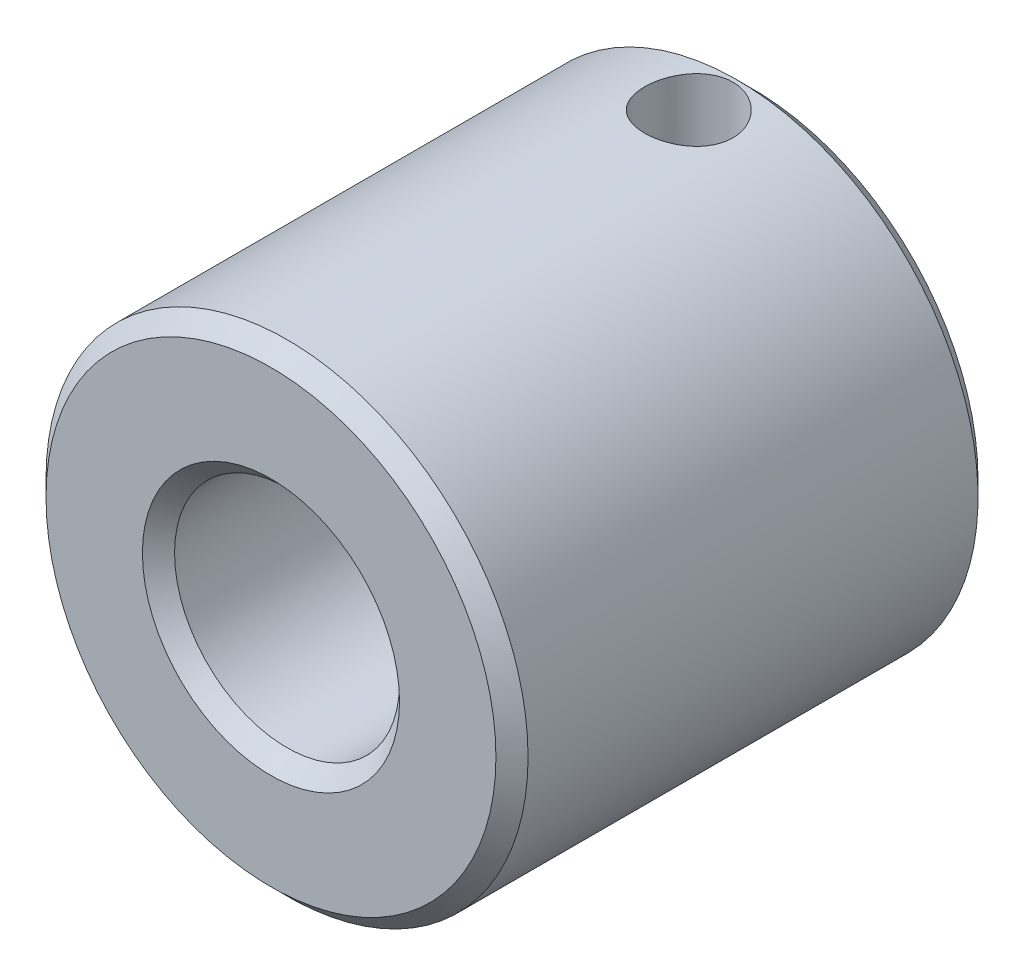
ISO-10303-21;
HEADER;
FILE_DESCRIPTION(('STEP AP214'),'2;1');
FILE_NAME('part.step','',(''),(''),'','','');
FILE_SCHEMA(('AUTOMOTIVE_DESIGN { 1 0 10303 214 1 1 1 1 }'));
ENDSEC;
DATA;
#1=APPLICATION_CONTEXT('core data for automotive mechanical design processes');
#2=APPLICATION_PROTOCOL_DEFINITION('international standard','automotive_design',2000,#1);
#3=PRODUCT_CONTEXT('',#1,'mechanical');
#4=PRODUCT('Part','Part','',(#3));
#5=PRODUCT_RELATED_PRODUCT_CATEGORY('part','',(#4));
#6=PRODUCT_DEFINITION_FORMATION('','',#4);
#7=PRODUCT_DEFINITION_CONTEXT('part definition',#1,'design');
#8=PRODUCT_DEFINITION('design','',#6,#7);
#9=PRODUCT_DEFINITION_SHAPE('','',#8);
#10=(LENGTH_UNIT() NAMED_UNIT(*) SI_UNIT(.MILLI.,.METRE.));
#11=(NAMED_UNIT(*) PLANE_ANGLE_UNIT() SI_UNIT($,.RADIAN.));
#12=(NAMED_UNIT(*) SI_UNIT($,.STERADIAN.) SOLID_ANGLE_UNIT());
#13=UNCERTAINTY_MEASURE_WITH_UNIT(LENGTH_MEASURE(1.E-05),#10,'distance_accuracy_value','');
#14=(GEOMETRIC_REPRESENTATION_CONTEXT(3) GLOBAL_UNCERTAINTY_ASSIGNED_CONTEXT((#13)) GLOBAL_UNIT_ASSIGNED_CONTEXT((#10,
#11,#12)) REPRESENTATION_CONTEXT('',''));
#15=CARTESIAN_POINT('',(0.,0.,0.));
#16=DIRECTION('',(0.,0.,1.));
#17=DIRECTION('',(1.,0.,0.));
#18=AXIS2_PLACEMENT_3D('',#15,#16,#17);
#19=CARTESIAN_POINT('',(0.,15.,4.));
#20=DIRECTION('',(0.,-1.,0.));
#21=DIRECTION('',(0.,0.,-1.));
#22=AXIS2_PLACEMENT_3D('',#19,#20,#21);
#23=CYLINDRICAL_SURFACE('',#22,2.75);
#24=CARTESIAN_POINT('',(0.,7.,6.75));
#25=CARTESIAN_POINT('',(-0.148185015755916,6.99999324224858,6.74999138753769));
#26=CARTESIAN_POINT('',(-0.29650217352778,6.9952447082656,6.73796447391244));
#27=CARTESIAN_POINT('',(-0.588838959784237,6.97673336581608,6.69031068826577));
#28=CARTESIAN_POINT('',(-0.732851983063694,6.96295737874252,6.6546493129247));
#29=CARTESIAN_POINT('',(-1.01207065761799,6.92787575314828,6.56121544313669));
#30=CARTESIAN_POINT('',(-1.14729928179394,6.90659077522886,6.50350358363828));
#31=CARTESIAN_POINT('',(-1.4060866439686,6.8585906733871,6.36786381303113));
#32=CARTESIAN_POINT('',(-1.52964566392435,6.83187568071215,6.28993639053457));
#33=CARTESIAN_POINT('',(-1.76733825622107,6.77437003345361,6.11232819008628));
#34=CARTESIAN_POINT('',(-1.88086697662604,6.74345616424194,6.01187816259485));
#35=CARTESIAN_POINT('',(-2.08996777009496,6.68161260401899,5.79370607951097));
#36=CARTESIAN_POINT('',(-2.18553278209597,6.65068291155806,5.67597726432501));
#37=CARTESIAN_POINT('',(-2.36000969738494,6.59084494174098,5.42048591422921));
#38=CARTESIAN_POINT('',(-2.43803824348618,6.5620790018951,5.28208338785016));
#39=CARTESIAN_POINT('',(-2.56943967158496,6.51175612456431,4.99281550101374));
#40=CARTESIAN_POINT('',(-2.6228234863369,6.49019599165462,4.84195570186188));
#41=CARTESIAN_POINT('',(-2.70098690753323,6.45804886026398,4.53901976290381));
#42=CARTESIAN_POINT('',(-2.72692489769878,6.4470195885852,4.38729111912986));
#43=CARTESIAN_POINT('',(-2.75308014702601,6.43589718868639,4.08126488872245));
#44=CARTESIAN_POINT('',(-2.75330944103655,6.43579894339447,3.92696853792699));
#45=CARTESIAN_POINT('',(-2.72892084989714,6.44617125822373,3.63115742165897));
#46=CARTESIAN_POINT('',(-2.70595946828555,6.45593722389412,3.48947664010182));
#47=CARTESIAN_POINT('',(-2.63859636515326,6.48375840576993,3.21216942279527));
#48=CARTESIAN_POINT('',(-2.59419101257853,6.50181502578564,3.07654401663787));
#49=CARTESIAN_POINT('',(-2.48436529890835,6.54457398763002,2.81199340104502));
#50=CARTESIAN_POINT('',(-2.41854194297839,6.56940216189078,2.68325673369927));
#51=CARTESIAN_POINT('',(-2.26803371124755,6.6228686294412,2.43820046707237));
#52=CARTESIAN_POINT('',(-2.18334269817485,6.65150816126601,2.32188492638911));
#53=CARTESIAN_POINT('',(-1.99011273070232,6.71196143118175,2.09588362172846));
#54=CARTESIAN_POINT('',(-1.880270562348,6.74385301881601,1.98733012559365));
#55=CARTESIAN_POINT('',(-1.643554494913,6.80541474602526,1.78979680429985));
#56=CARTESIAN_POINT('',(-1.51667251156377,6.83508382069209,1.70082632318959));
#57=CARTESIAN_POINT('',(-1.24632382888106,6.8895603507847,1.54356015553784));
#58=CARTESIAN_POINT('',(-1.10258687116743,6.91426423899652,1.47569135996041));
#59=CARTESIAN_POINT('',(-0.804656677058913,6.95521385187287,1.36558569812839));
#60=CARTESIAN_POINT('',(-0.65048517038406,6.97147657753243,1.3232972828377));
#61=CARTESIAN_POINT('',(-0.412349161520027,6.98832346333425,1.27983028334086));
#62=CARTESIAN_POINT('',(-0.330353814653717,6.9926864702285,1.26866141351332));
#63=CARTESIAN_POINT('',(-0.165586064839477,6.99852661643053,1.25374389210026));
#64=CARTESIAN_POINT('',(-0.0828136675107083,7.00000377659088,1.24999518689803));
#65=CARTESIAN_POINT('',(0.148185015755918,6.99999324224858,1.25000861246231));
#66=CARTESIAN_POINT('',(0.296502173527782,6.9952447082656,1.26203552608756));
#67=CARTESIAN_POINT('',(0.588838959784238,6.97673336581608,1.30968931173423));
#68=CARTESIAN_POINT('',(0.732851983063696,6.96295737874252,1.3453506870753));
#69=CARTESIAN_POINT('',(1.01207065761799,6.92787575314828,1.43878455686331));
#70=CARTESIAN_POINT('',(1.14729928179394,6.90659077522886,1.49649641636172));
#71=CARTESIAN_POINT('',(1.4060866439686,6.8585906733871,1.63213618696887));
#72=CARTESIAN_POINT('',(1.52964566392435,6.83187568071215,1.71006360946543));
#73=CARTESIAN_POINT('',(1.76733825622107,6.77437003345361,1.88767180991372));
#74=CARTESIAN_POINT('',(1.88086697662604,6.74345616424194,1.98812183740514));
#75=CARTESIAN_POINT('',(2.08996777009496,6.68161260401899,2.20629392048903));
#76=CARTESIAN_POINT('',(2.18553278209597,6.65068291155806,2.32402273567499));
#77=CARTESIAN_POINT('',(2.36000969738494,6.59084494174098,2.57951408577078));
#78=CARTESIAN_POINT('',(2.43803824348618,6.56207900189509,2.71791661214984));
#79=CARTESIAN_POINT('',(2.56943967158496,6.51175612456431,3.00718449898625));
#80=CARTESIAN_POINT('',(2.6228234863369,6.49019599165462,3.15804429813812));
#81=CARTESIAN_POINT('',(2.70098690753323,6.45804886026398,3.46098023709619));
#82=CARTESIAN_POINT('',(2.72692489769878,6.4470195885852,3.61270888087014));
#83=CARTESIAN_POINT('',(2.75308014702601,6.43589718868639,3.91873511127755));
#84=CARTESIAN_POINT('',(2.75330944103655,6.43579894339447,4.07303146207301));
#85=CARTESIAN_POINT('',(2.72892084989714,6.44617125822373,4.36884257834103));
#86=CARTESIAN_POINT('',(2.70595946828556,6.45593722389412,4.51052335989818));
#87=CARTESIAN_POINT('',(2.63859636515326,6.48375840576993,4.78783057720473));
#88=CARTESIAN_POINT('',(2.59419101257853,6.50181502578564,4.92345598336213));
#89=CARTESIAN_POINT('',(2.48436529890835,6.54457398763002,5.18800659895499));
#90=CARTESIAN_POINT('',(2.41854194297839,6.56940216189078,5.31674326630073));
#91=CARTESIAN_POINT('',(2.26803371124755,6.6228686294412,5.56179953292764));
#92=CARTESIAN_POINT('',(2.18334269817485,6.65150816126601,5.67811507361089));
#93=CARTESIAN_POINT('',(1.99011273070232,6.71196143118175,5.90411637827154));
#94=CARTESIAN_POINT('',(1.880270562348,6.74385301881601,6.01266987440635));
#95=CARTESIAN_POINT('',(1.643554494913,6.80541474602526,6.21020319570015));
#96=CARTESIAN_POINT('',(1.51667251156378,6.83508382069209,6.29917367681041));
#97=CARTESIAN_POINT('',(1.24632382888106,6.8895603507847,6.45643984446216));
#98=CARTESIAN_POINT('',(1.10258687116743,6.91426423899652,6.52430864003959));
#99=CARTESIAN_POINT('',(0.804656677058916,6.95521385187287,6.63441430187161));
#100=CARTESIAN_POINT('',(0.650485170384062,6.97147657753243,6.6767027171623));
#101=CARTESIAN_POINT('',(0.412349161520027,6.98832346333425,6.72016971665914));
#102=CARTESIAN_POINT('',(0.330353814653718,6.9926864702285,6.73133858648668));
#103=CARTESIAN_POINT('',(0.165586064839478,6.99852661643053,6.74625610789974));
#104=CARTESIAN_POINT('',(0.0828136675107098,7.00000377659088,6.75000481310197));
#105=CARTESIAN_POINT('',(0.,7.,6.75));
#106=B_SPLINE_CURVE_WITH_KNOTS('',3,(#24,#25,#26,#27,#28,#29,#30,#31,#32,#33,#34,#35,#36,#37,
#38,#39,#40,#41,#42,#43,#44,#45,#46,#47,#48,#49,#50,#51,#52,#53,#54,#55,#56,#57,#58,#59,#60,#61,
#62,#63,#64,#65,#66,#67,#68,#69,#70,#71,#72,#73,#74,#75,#76,#77,#78,#79,#80,#81,#82,#83,#84,#85,
#86,#87,#88,#89,#90,#91,#92,#93,#94,#95,#96,#97,#98,#99,#100,#101,#102,#103,#104,#105),
.UNSPECIFIED.,.T.,.F.,(4,2,2,2,2,2,2,2,2,2,2,2,2,2,2,2,2,2,2,2,2,2,2,2,2,2,2,2,2,2,2,2,2,2,2,2,
2,2,2,2,4),(0.,0.444233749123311,0.8891174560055,1.33278651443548,1.77644485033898,
2.23853520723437,2.70080682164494,3.18278066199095,3.66454048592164,4.12503938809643,
4.58532271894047,5.01490113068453,5.44455230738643,5.88280670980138,6.32120387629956,
6.79212913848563,7.2632786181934,7.74341814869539,8.2225868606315,8.47085009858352,
8.71911154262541,9.16334529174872,9.6082289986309,10.0518980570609,10.4955563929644,
10.9576467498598,11.4199183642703,11.9018922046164,12.383652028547,12.8441509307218,
13.3044342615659,13.7340126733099,14.1636638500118,14.6019182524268,15.040315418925,
15.511240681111,15.9823901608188,16.4625296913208,16.9416984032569,17.1899616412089,
17.4382230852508),.UNSPECIFIED.);
#107=CARTESIAN_POINT('',(0.,7.,6.75));
#108=VERTEX_POINT('',#107);
#109=EDGE_CURVE('E45',#108,#108,#106,.T.);
#110=ORIENTED_EDGE('',*,*,#109,.T.);
#111=EDGE_LOOP('',(#110));
#112=FACE_BOUND('',#111,.T.);
#113=CARTESIAN_POINT('',(0.,15.,6.75));
#114=CARTESIAN_POINT('',(-0.152939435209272,14.9999967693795,6.74999281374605));
#115=CARTESIAN_POINT('',(-0.306071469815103,14.997634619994,6.7371870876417));
#116=CARTESIAN_POINT('',(-0.608143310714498,14.9884323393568,6.68629994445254));
#117=CARTESIAN_POINT('',(-0.757074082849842,14.9815832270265,6.64816783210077));
#118=CARTESIAN_POINT('',(-1.04615408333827,14.9641738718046,6.54782757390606));
#119=CARTESIAN_POINT('',(-1.18631467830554,14.9536185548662,6.48565137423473));
#120=CARTESIAN_POINT('',(-1.45415890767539,14.9299538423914,6.33906615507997));
#121=CARTESIAN_POINT('',(-1.58184691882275,14.9168453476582,6.25466497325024));
#122=CARTESIAN_POINT('',(-1.82266162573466,14.889350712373,6.06497899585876));
#123=CARTESIAN_POINT('',(-1.9356233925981,14.8749527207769,5.95948649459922));
#124=CARTESIAN_POINT('',(-2.14235500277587,14.8465898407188,5.73105441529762));
#125=CARTESIAN_POINT('',(-2.23612249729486,14.8326250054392,5.60811270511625));
#126=CARTESIAN_POINT('',(-2.40246884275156,14.8065968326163,5.34713206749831));
#127=CARTESIAN_POINT('',(-2.4748830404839,14.7945485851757,5.2089865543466));
#128=CARTESIAN_POINT('',(-2.59541249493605,14.7738822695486,4.92223450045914));
#129=CARTESIAN_POINT('',(-2.64352995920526,14.7652638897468,4.77362891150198));
#130=CARTESIAN_POINT('',(-2.71357913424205,14.7525507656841,4.47191721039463));
#131=CARTESIAN_POINT('',(-2.73579492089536,14.7484069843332,4.31887915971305));
#132=CARTESIAN_POINT('',(-2.75429165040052,14.7449642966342,4.01119574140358));
#133=CARTESIAN_POINT('',(-2.75057477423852,14.7456649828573,3.85655051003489));
#134=CARTESIAN_POINT('',(-2.71754232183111,14.751787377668,3.55209589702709));
#135=CARTESIAN_POINT('',(-2.68854917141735,14.7571496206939,3.40225016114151));
#136=CARTESIAN_POINT('',(-2.60629417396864,14.7718976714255,3.10958521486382));
#137=CARTESIAN_POINT('',(-2.55303114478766,14.7812836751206,2.96676634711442));
#138=CARTESIAN_POINT('',(-2.42342864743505,14.8030846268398,2.69125826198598));
#139=CARTESIAN_POINT('',(-2.34695749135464,14.815516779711,2.55863241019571));
#140=CARTESIAN_POINT('',(-2.17320882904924,14.8419965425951,2.30798340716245));
#141=CARTESIAN_POINT('',(-2.07593087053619,14.8560441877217,2.18996057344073));
#142=CARTESIAN_POINT('',(-1.86160679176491,14.8844299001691,1.97001308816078));
#143=CARTESIAN_POINT('',(-1.74428821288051,14.8987691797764,1.86835393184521));
#144=CARTESIAN_POINT('',(-1.4940603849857,14.9259369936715,1.68607542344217));
#145=CARTESIAN_POINT('',(-1.36114426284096,14.9387648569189,1.60546539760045));
#146=CARTESIAN_POINT('',(-1.08318739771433,14.9614900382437,1.46754334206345));
#147=CARTESIAN_POINT('',(-0.938123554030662,14.9713816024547,1.41027697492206));
#148=CARTESIAN_POINT('',(-0.640402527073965,14.9870605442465,1.32111261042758));
#149=CARTESIAN_POINT('',(-0.487762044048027,14.9928565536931,1.28916124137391));
#150=CARTESIAN_POINT('',(-0.278324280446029,14.9975209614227,1.26354988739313));
#151=CARTESIAN_POINT('',(-0.222792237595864,14.9984485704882,1.2584728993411));
#152=CARTESIAN_POINT('',(-0.111515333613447,14.999688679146,1.25169664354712));
#153=CARTESIAN_POINT('',(-0.0557704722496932,15.0000011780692,1.24999737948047));
#154=CARTESIAN_POINT('',(0.152939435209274,14.9999967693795,1.25000718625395));
#155=CARTESIAN_POINT('',(0.306071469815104,14.997634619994,1.2628129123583));
#156=CARTESIAN_POINT('',(0.6081433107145,14.9884323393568,1.31370005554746));
#157=CARTESIAN_POINT('',(0.757074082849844,14.9815832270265,1.35183216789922));
#158=CARTESIAN_POINT('',(1.04615408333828,14.9641738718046,1.45217242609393));
#159=CARTESIAN_POINT('',(1.18631467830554,14.9536185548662,1.51434862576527));
#160=CARTESIAN_POINT('',(1.45415890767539,14.9299538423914,1.66093384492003));
#161=CARTESIAN_POINT('',(1.58184691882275,14.9168453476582,1.74533502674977));
#162=CARTESIAN_POINT('',(1.82266162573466,14.889350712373,1.93502100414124));
#163=CARTESIAN_POINT('',(1.9356233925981,14.8749527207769,2.04051350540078));
#164=CARTESIAN_POINT('',(2.14235500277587,14.8465898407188,2.26894558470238));
#165=CARTESIAN_POINT('',(2.23612249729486,14.8326250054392,2.39188729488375));
#166=CARTESIAN_POINT('',(2.40246884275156,14.8065968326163,2.65286793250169));
#167=CARTESIAN_POINT('',(2.4748830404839,14.7945485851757,2.7910134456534));
#168=CARTESIAN_POINT('',(2.59541249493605,14.7738822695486,3.07776549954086));
#169=CARTESIAN_POINT('',(2.64352995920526,14.7652638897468,3.22637108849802));
#170=CARTESIAN_POINT('',(2.71357913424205,14.7525507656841,3.52808278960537));
#171=CARTESIAN_POINT('',(2.73579492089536,14.7484069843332,3.68112084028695));
#172=CARTESIAN_POINT('',(2.75429165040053,14.7449642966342,3.98880425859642));
#173=CARTESIAN_POINT('',(2.75057477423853,14.7456649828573,4.14344948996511));
#174=CARTESIAN_POINT('',(2.71754232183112,14.751787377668,4.44790410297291));
#175=CARTESIAN_POINT('',(2.68854917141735,14.7571496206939,4.59774983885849));
#176=CARTESIAN_POINT('',(2.60629417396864,14.7718976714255,4.89041478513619));
#177=CARTESIAN_POINT('',(2.55303114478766,14.7812836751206,5.03323365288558));
#178=CARTESIAN_POINT('',(2.42342864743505,14.8030846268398,5.30874173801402));
#179=CARTESIAN_POINT('',(2.34695749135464,14.815516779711,5.44136758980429));
#180=CARTESIAN_POINT('',(2.17320882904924,14.8419965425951,5.69201659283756));
#181=CARTESIAN_POINT('',(2.07593087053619,14.8560441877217,5.81003942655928));
#182=CARTESIAN_POINT('',(1.86160679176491,14.8844299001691,6.02998691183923));
#183=CARTESIAN_POINT('',(1.74428821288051,14.8987691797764,6.13164606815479));
#184=CARTESIAN_POINT('',(1.4940603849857,14.9259369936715,6.31392457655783));
#185=CARTESIAN_POINT('',(1.36114426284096,14.9387648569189,6.39453460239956));
#186=CARTESIAN_POINT('',(1.08318739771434,14.9614900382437,6.53245665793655));
#187=CARTESIAN_POINT('',(0.938123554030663,14.9713816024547,6.58972302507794));
#188=CARTESIAN_POINT('',(0.640402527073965,14.9870605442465,6.67888738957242));
#189=CARTESIAN_POINT('',(0.487762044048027,14.9928565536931,6.71083875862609));
#190=CARTESIAN_POINT('',(0.27832428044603,14.9975209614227,6.73645011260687));
#191=CARTESIAN_POINT('',(0.222792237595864,14.9984485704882,6.7415271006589));
#192=CARTESIAN_POINT('',(0.111515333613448,14.999688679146,6.74830335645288));
#193=CARTESIAN_POINT('',(0.055770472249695,15.0000011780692,6.75000262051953));
#194=CARTESIAN_POINT('',(0.,15.,6.75));
#195=B_SPLINE_CURVE_WITH_KNOTS('',3,(#113,#114,#115,#116,#117,#118,#119,#120,#121,#122,#123,
#124,#125,#126,#127,#128,#129,#130,#131,#132,#133,#134,#135,#136,#137,#138,#139,#140,#141,#142,
#143,#144,#145,#146,#147,#148,#149,#150,#151,#152,#153,#154,#155,#156,#157,#158,#159,#160,#161,
#162,#163,#164,#165,#166,#167,#168,#169,#170,#171,#172,#173,#174,#175,#176,#177,#178,#179,#180,
#181,#182,#183,#184,#185,#186,#187,#188,#189,#190,#191,#192,#193,#194),.UNSPECIFIED.,.T.,.F.,(4,
2,2,2,2,2,2,2,2,2,2,2,2,2,2,2,2,2,2,2,2,2,2,2,2,2,2,2,2,2,2,2,2,2,2,2,2,2,2,2,4),(0.,
0.458605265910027,0.918131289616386,1.37704885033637,1.83580478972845,2.2993232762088,
2.76289844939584,3.22995995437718,3.69697901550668,4.15882638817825,4.6206349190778,
5.07663738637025,5.53266206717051,5.99132430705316,6.44999651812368,6.91548961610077,
7.38118861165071,7.84779423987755,8.31341348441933,8.48064703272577,8.64788076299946,
9.10648602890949,9.56601205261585,10.0249296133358,10.4836855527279,10.9472040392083,
11.4107792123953,11.8778407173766,12.3448597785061,12.8067071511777,13.2685156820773,
13.7245181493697,14.18054283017,14.6392050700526,15.0978772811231,15.5633703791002,
16.0290693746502,16.495675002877,16.9612942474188,17.1285277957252,17.2957615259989),.UNSPECIFIED.);
#196=CARTESIAN_POINT('',(0.,15.,6.75));
#197=VERTEX_POINT('',#196);
#198=EDGE_CURVE('E44',#197,#197,#195,.T.);
#199=ORIENTED_EDGE('',*,*,#198,.F.);
#200=EDGE_LOOP('',(#199));
#201=FACE_BOUND('',#200,.T.);
#202=ADVANCED_FACE('F12',(#112,#201),#23,.F.);
#203=CARTESIAN_POINT('',(0.,0.,0.));
#204=DIRECTION('',(0.,0.,-1.));
#205=DIRECTION('',(-1.,0.,0.));
#206=AXIS2_PLACEMENT_3D('',#203,#204,#205);
#207=CYLINDRICAL_SURFACE('',#206,7.);
#208=CARTESIAN_POINT('',(0.,0.,1.));
#209=DIRECTION('',(0.,0.,-1.));
#210=DIRECTION('',(-1.,0.,0.));
#211=AXIS2_PLACEMENT_3D('',#208,#209,#210);
#212=CIRCLE('',#211,7.);
#213=CARTESIAN_POINT('',(-7.,0.,1.));
#214=VERTEX_POINT('',#213);
#215=EDGE_CURVE('E32',#214,#214,#212,.T.);
#216=ORIENTED_EDGE('',*,*,#215,.T.);
#217=EDGE_LOOP('',(#216));
#218=FACE_BOUND('',#217,.T.);
#219=CARTESIAN_POINT('',(0.,0.,29.));
#220=DIRECTION('',(0.,0.,1.));
#221=DIRECTION('',(1.,0.,0.));
#222=AXIS2_PLACEMENT_3D('',#219,#220,#221);
#223=CIRCLE('',#222,7.);
#224=CARTESIAN_POINT('',(7.,0.,29.));
#225=VERTEX_POINT('',#224);
#226=EDGE_CURVE('E35',#225,#225,#223,.T.);
#227=ORIENTED_EDGE('',*,*,#226,.T.);
#228=EDGE_LOOP('',(#227));
#229=FACE_BOUND('',#228,.T.);
#230=ORIENTED_EDGE('',*,*,#109,.F.);
#231=EDGE_LOOP('',(#230));
#232=FACE_BOUND('',#231,.T.);
#233=ADVANCED_FACE('F59',(#218,#229,#232),#207,.F.);
#234=CARTESIAN_POINT('',(0.,15.,30.));
#235=DIRECTION('',(0.,0.,1.));
#236=DIRECTION('',(1.,0.,0.));
#237=AXIS2_PLACEMENT_3D('',#234,#235,#236);
#238=PLANE('',#237);
#239=CARTESIAN_POINT('',(0.,0.,30.));
#240=DIRECTION('',(0.,0.,1.));
#241=DIRECTION('',(1.,0.,0.));
#242=AXIS2_PLACEMENT_3D('',#239,#240,#241);
#243=CIRCLE('',#242,14.);
#244=CARTESIAN_POINT('',(14.,0.,30.));
#245=VERTEX_POINT('',#244);
#246=EDGE_CURVE('E8',#245,#245,#243,.T.);
#247=ORIENTED_EDGE('',*,*,#246,.T.);
#248=EDGE_LOOP('',(#247));
#249=FACE_BOUND('',#248,.T.);
#250=CARTESIAN_POINT('',(0.,0.,30.));
#251=DIRECTION('',(0.,0.,1.));
#252=DIRECTION('',(1.,0.,0.));
#253=AXIS2_PLACEMENT_3D('',#250,#251,#252);
#254=CIRCLE('',#253,8.);
#255=CARTESIAN_POINT('',(8.,0.,30.));
#256=VERTEX_POINT('',#255);
#257=EDGE_CURVE('E19',#256,#256,#254,.F.);
#258=ORIENTED_EDGE('',*,*,#257,.T.);
#259=EDGE_LOOP('',(#258));
#260=FACE_BOUND('',#259,.T.);
#261=ADVANCED_FACE('F63',(#249,#260),#238,.T.);
#262=CARTESIAN_POINT('',(0.,15.,0.));
#263=DIRECTION('',(0.,0.,-1.));
#264=DIRECTION('',(-1.,0.,0.));
#265=AXIS2_PLACEMENT_3D('',#262,#263,#264);
#266=PLANE('',#265);
#267=CARTESIAN_POINT('',(0.,0.,0.));
#268=DIRECTION('',(0.,0.,-1.));
#269=DIRECTION('',(-1.,0.,0.));
#270=AXIS2_PLACEMENT_3D('',#267,#268,#269);
#271=CIRCLE('',#270,8.);
#272=CARTESIAN_POINT('',(-8.,0.,0.));
#273=VERTEX_POINT('',#272);
#274=EDGE_CURVE('E38',#273,#273,#271,.F.);
#275=ORIENTED_EDGE('',*,*,#274,.T.);
#276=EDGE_LOOP('',(#275));
#277=FACE_BOUND('',#276,.T.);
#278=CARTESIAN_POINT('',(0.,0.,0.));
#279=DIRECTION('',(0.,0.,-1.));
#280=DIRECTION('',(-1.,0.,0.));
#281=AXIS2_PLACEMENT_3D('',#278,#279,#280);
#282=CIRCLE('',#281,14.);
#283=CARTESIAN_POINT('',(-14.,0.,0.));
#284=VERTEX_POINT('',#283);
#285=EDGE_CURVE('E41',#284,#284,#282,.T.);
#286=ORIENTED_EDGE('',*,*,#285,.T.);
#287=EDGE_LOOP('',(#286));
#288=FACE_BOUND('',#287,.T.);
#289=ADVANCED_FACE('F67',(#277,#288),#266,.T.);
#290=CARTESIAN_POINT('',(0.,0.,0.));
#291=DIRECTION('',(0.,0.,-1.));
#292=DIRECTION('',(-1.,0.,0.));
#293=AXIS2_PLACEMENT_3D('',#290,#291,#292);
#294=CYLINDRICAL_SURFACE('',#293,15.);
#295=CARTESIAN_POINT('',(0.,0.,1.));
#296=DIRECTION('',(0.,0.,-1.));
#297=DIRECTION('',(-1.,0.,0.));
#298=AXIS2_PLACEMENT_3D('',#295,#296,#297);
#299=CIRCLE('',#298,15.);
#300=CARTESIAN_POINT('',(-15.,0.,1.));
#301=VERTEX_POINT('',#300);
#302=EDGE_CURVE('E23',#301,#301,#299,.F.);
#303=ORIENTED_EDGE('',*,*,#302,.T.);
#304=EDGE_LOOP('',(#303));
#305=FACE_BOUND('',#304,.T.);
#306=CARTESIAN_POINT('',(0.,0.,29.));
#307=DIRECTION('',(0.,0.,1.));
#308=DIRECTION('',(1.,0.,0.));
#309=AXIS2_PLACEMENT_3D('',#306,#307,#308);
#310=CIRCLE('',#309,15.);
#311=CARTESIAN_POINT('',(15.,0.,29.));
#312=VERTEX_POINT('',#311);
#313=EDGE_CURVE('E27',#312,#312,#310,.F.);
#314=ORIENTED_EDGE('',*,*,#313,.T.);
#315=EDGE_LOOP('',(#314));
#316=FACE_BOUND('',#315,.T.);
#317=ORIENTED_EDGE('',*,*,#198,.T.);
#318=EDGE_LOOP('',(#317));
#319=FACE_BOUND('',#318,.T.);
#320=ADVANCED_FACE('F69',(#305,#316,#319),#294,.T.);
#321=CARTESIAN_POINT('',(0.,0.,0.));
#322=DIRECTION('',(0.,0.,-1.));
#323=DIRECTION('',(-1.,0.,0.));
#324=AXIS2_PLACEMENT_3D('',#321,#322,#323);
#325=CONICAL_SURFACE('',#324,8.,0.785398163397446);
#326=ORIENTED_EDGE('',*,*,#215,.F.);
#327=EDGE_LOOP('',(#326));
#328=FACE_BOUND('',#327,.T.);
#329=ORIENTED_EDGE('',*,*,#274,.F.);
#330=EDGE_LOOP('',(#329));
#331=FACE_BOUND('',#330,.T.);
#332=ADVANCED_FACE('F73',(#328,#331),#325,.F.);
#333=CARTESIAN_POINT('',(0.,0.,1.));
#334=DIRECTION('',(0.,0.,1.));
#335=DIRECTION('',(1.,0.,0.));
#336=AXIS2_PLACEMENT_3D('',#333,#334,#335);
#337=CONICAL_SURFACE('',#336,15.,0.785398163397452);
#338=ORIENTED_EDGE('',*,*,#285,.F.);
#339=EDGE_LOOP('',(#338));
#340=FACE_BOUND('',#339,.T.);
#341=ORIENTED_EDGE('',*,*,#302,.F.);
#342=EDGE_LOOP('',(#341));
#343=FACE_BOUND('',#342,.T.);
#344=ADVANCED_FACE('F80',(#340,#343),#337,.T.);
#345=CARTESIAN_POINT('',(0.,0.,29.));
#346=DIRECTION('',(0.,0.,-1.));
#347=DIRECTION('',(-1.,0.,0.));
#348=AXIS2_PLACEMENT_3D('',#345,#346,#347);
#349=CONICAL_SURFACE('',#348,15.,0.785398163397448);
#350=ORIENTED_EDGE('',*,*,#246,.F.);
#351=EDGE_LOOP('',(#350));
#352=FACE_BOUND('',#351,.T.);
#353=ORIENTED_EDGE('',*,*,#313,.F.);
#354=EDGE_LOOP('',(#353));
#355=FACE_BOUND('',#354,.T.);
#356=ADVANCED_FACE('F135',(#352,#355),#349,.T.);
#357=CARTESIAN_POINT('',(0.,0.,30.));
#358=DIRECTION('',(0.,0.,1.));
#359=DIRECTION('',(1.,0.,0.));
#360=AXIS2_PLACEMENT_3D('',#357,#358,#359);
#361=CONICAL_SURFACE('',#360,8.,0.785398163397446);
#362=ORIENTED_EDGE('',*,*,#226,.F.);
#363=EDGE_LOOP('',(#362));
#364=FACE_BOUND('',#363,.T.);
#365=ORIENTED_EDGE('',*,*,#257,.F.);
#366=EDGE_LOOP('',(#365));
#367=FACE_BOUND('',#366,.T.);
#368=ADVANCED_FACE('F14',(#364,#367),#361,.F.);
#369=CLOSED_SHELL('',(#202,#233,#261,#289,#320,#332,#344,#356,#368));
#370=MANIFOLD_SOLID_BREP('B1',#369);
#371=ADVANCED_BREP_SHAPE_REPRESENTATION('',(#18,#370),#14);
#372=SHAPE_DEFINITION_REPRESENTATION(#9,#371);
ENDSEC;
END-ISO-10303-21;
